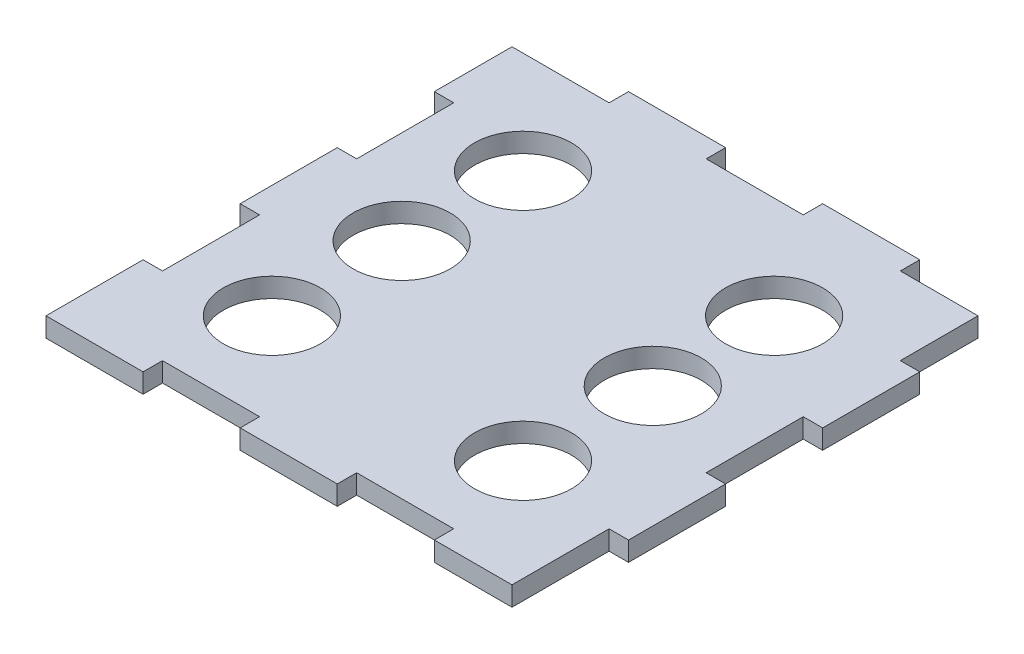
from build123d import *

# Parameters (mm, degrees)
SKETCH2_R           = 10
BOSS_EXTRUDE1_DEPTH = 4


with BuildPart() as part:
    # Sketch2 → Boss-Extrude1 (new body)
    with BuildSketch(Plane(origin=(0, 0, 0), x_dir=(1, 0, 0), z_dir=(0, 1, 0))):
        Polygon((-50, 46), (-30, 46), (-30, 50), (-10, 50), (-10, 46), (10, 46), (10, 50), (30, 50), (30, 46), (46, 46), (46, 30), (50, 30), (50, 10), (46, 10), (46, -10), (50, -10), (50, -30), (46, -30), (46, -50), (30, -50), (30, -46), (10, -46), (10, -50), (-10, -50), (-10, -46), (-30, -46), (-30, -50), (-50, -50), (-50, -30), (-46, -30), (-46, -10), (-50, -10), (-50, 10), (-46, 10), (-46, 30), (-50, 30), align=None)
        with Locations(Location((-26.732086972, 25, 0), (0, 0, 270))):
            Circle(SKETCH2_R, mode=Mode.SUBTRACT)
        with Locations(Location((-26.732086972, 0, 0), (0, 0, 270))):
            Circle(SKETCH2_R, mode=Mode.SUBTRACT)
        with Locations(Location((-26.732086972, -26.732086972, 0), (0, 0, 270))):
            Circle(SKETCH2_R, mode=Mode.SUBTRACT)
        with Locations(Location((25, 25, 0), (0, 0, 270))):
            Circle(SKETCH2_R, mode=Mode.SUBTRACT)
        with Locations(Location((25, 0, 0), (0, 0, 270))):
            Circle(SKETCH2_R, mode=Mode.SUBTRACT)
        with Locations(Location((25, -26.732086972, 0), (0, 0, 270))):
            Circle(SKETCH2_R, mode=Mode.SUBTRACT)
    extrude(amount=BOSS_EXTRUDE1_DEPTH)


solid = part.part
